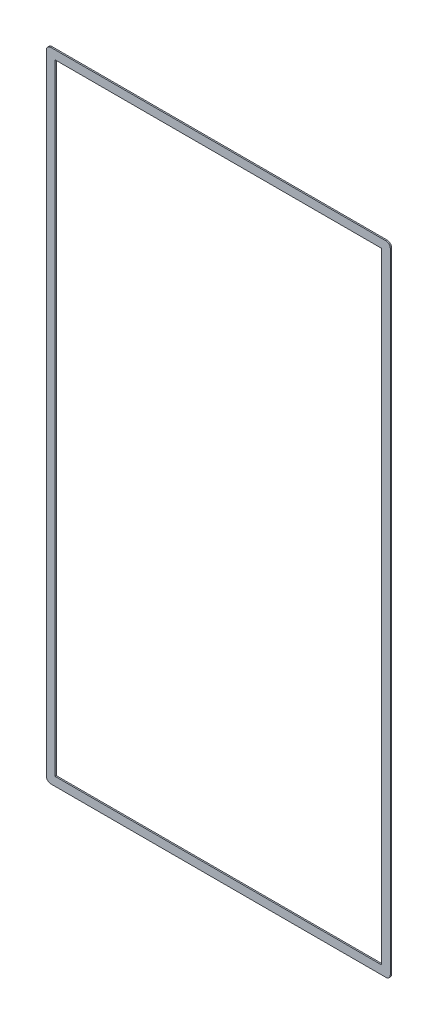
from build123d import *

# Parameters (mm, degrees)
BOSS_EXTRUDE1_DEPTH = 1.905
SHELL1_T            = -12.7


with BuildPart() as part:
    # Sketch1 → Boss-Extrude1 (new body)
    with BuildSketch(Plane.XY):
        with BuildLine():
            Line((-251.968, 461.137), (-251.968, -461.137))
            ThreePointArc((-251.968, -461.137), (-250.108128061, -465.627128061), (-245.618, -467.487))
            Line((-245.618, -467.487), (245.618, -467.487))
            ThreePointArc((245.618, -467.487), (250.108128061, -465.627128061), (251.968, -461.137))
            Line((251.968, -461.137), (251.968, 461.137))
            ThreePointArc((251.968, 461.137), (250.108128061, 465.627128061), (245.618, 467.487))
            Line((245.618, 467.487), (-245.618, 467.487))
            ThreePointArc((-245.618, 467.487), (-250.108128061, 465.627128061), (-251.968, 461.137))
        make_face()
    extrude(amount=BOSS_EXTRUDE1_DEPTH)

    # Shell1
    shell1_openings = [part.faces().sort_by_distance(p)[0] for p in [
        (0, 0, 1.905),
        (0, 0, 0),
    ]]
    offset(amount=SHELL1_T, openings=shell1_openings, kind=Kind.INTERSECTION)


solid = part.part
